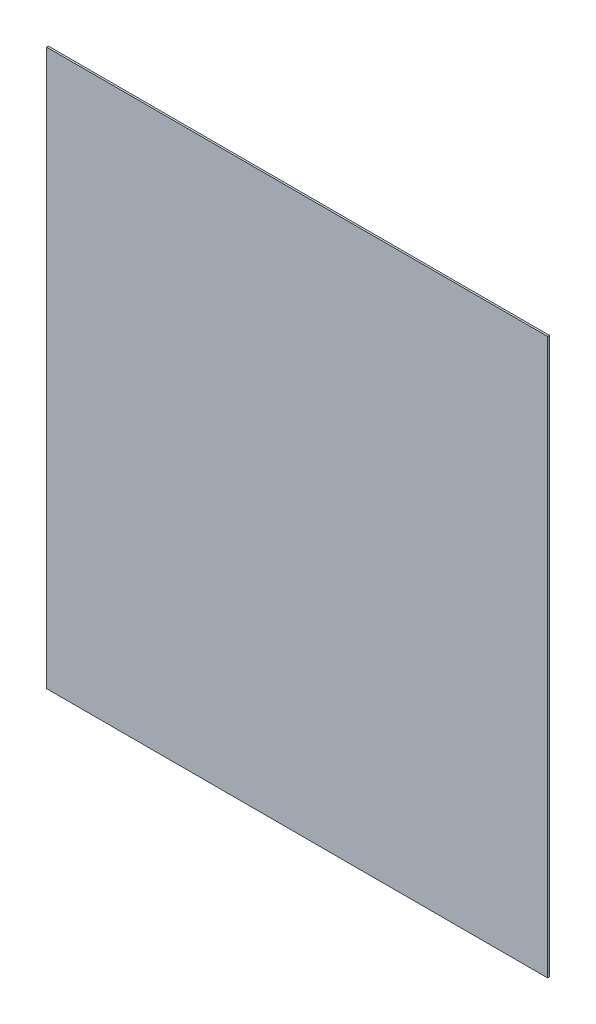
from build123d import *

# Parameters (mm, degrees)
SKIZZE1_W                       = 1090
SKIZZE1_H                       = 1208
AUFSATZ_LINEAR_AUSTRAGEN1_DEPTH = 4


with BuildPart() as part:
    # Skizze1 → Aufsatz-Linear austragen1 (new body)
    with BuildSketch(Plane.XY):
        with Locations((-545, 604)):
            Rectangle(SKIZZE1_W, SKIZZE1_H)
    extrude(amount=AUFSATZ_LINEAR_AUSTRAGEN1_DEPTH)


solid = part.part
